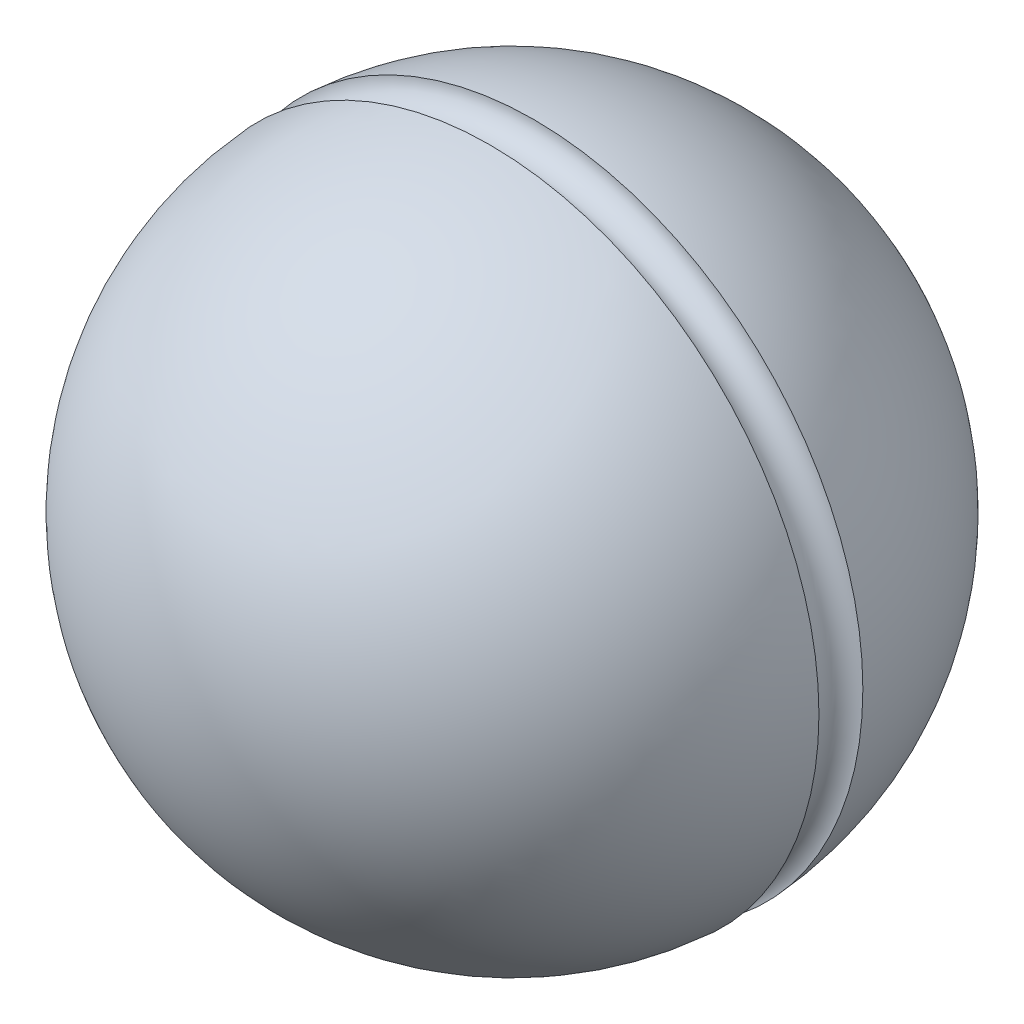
ISO-10303-21;
HEADER;
FILE_DESCRIPTION(('STEP AP214'),'2;1');
FILE_NAME('part.step','',(''),(''),'','','');
FILE_SCHEMA(('AUTOMOTIVE_DESIGN { 1 0 10303 214 1 1 1 1 }'));
ENDSEC;
DATA;
#1=APPLICATION_CONTEXT('core data for automotive mechanical design processes');
#2=APPLICATION_PROTOCOL_DEFINITION('international standard','automotive_design',2000,#1);
#3=PRODUCT_CONTEXT('',#1,'mechanical');
#4=PRODUCT('Part','Part','',(#3));
#5=PRODUCT_RELATED_PRODUCT_CATEGORY('part','',(#4));
#6=PRODUCT_DEFINITION_FORMATION('','',#4);
#7=PRODUCT_DEFINITION_CONTEXT('part definition',#1,'design');
#8=PRODUCT_DEFINITION('design','',#6,#7);
#9=PRODUCT_DEFINITION_SHAPE('','',#8);
#10=(LENGTH_UNIT() NAMED_UNIT(*) SI_UNIT(.MILLI.,.METRE.));
#11=(NAMED_UNIT(*) PLANE_ANGLE_UNIT() SI_UNIT($,.RADIAN.));
#12=(NAMED_UNIT(*) SI_UNIT($,.STERADIAN.) SOLID_ANGLE_UNIT());
#13=UNCERTAINTY_MEASURE_WITH_UNIT(LENGTH_MEASURE(1.E-05),#10,'distance_accuracy_value','');
#14=(GEOMETRIC_REPRESENTATION_CONTEXT(3) GLOBAL_UNCERTAINTY_ASSIGNED_CONTEXT((#13)) GLOBAL_UNIT_ASSIGNED_CONTEXT((#10,
#11,#12)) REPRESENTATION_CONTEXT('',''));
#15=CARTESIAN_POINT('',(0.,0.,0.));
#16=DIRECTION('',(0.,0.,1.));
#17=DIRECTION('',(1.,0.,0.));
#18=AXIS2_PLACEMENT_3D('',#15,#16,#17);
#19=CARTESIAN_POINT('',(5.,0.,18.));
#20=DIRECTION('',(0.,0.,-1.));
#21=DIRECTION('',(0.,1.,0.));
#22=AXIS2_PLACEMENT_3D('',#19,#20,#21);
#23=PLANE('',#22);
#24=CARTESIAN_POINT('',(0.,0.,18.));
#25=DIRECTION('',(0.,0.,-1.));
#26=DIRECTION('',(0.,1.,0.));
#27=AXIS2_PLACEMENT_3D('',#24,#25,#26);
#28=CIRCLE('',#27,5.);
#29=CARTESIAN_POINT('',(0.,5.,18.));
#30=VERTEX_POINT('',#29);
#31=EDGE_CURVE('E8',#30,#30,#28,.T.);
#32=ORIENTED_EDGE('',*,*,#31,.T.);
#33=EDGE_LOOP('',(#32));
#34=FACE_BOUND('',#33,.T.);
#35=ADVANCED_FACE('F12',(#34),#23,.T.);
#36=CARTESIAN_POINT('',(0.,0.,0.));
#37=DIRECTION('',(0.,0.,-1.));
#38=DIRECTION('',(0.,1.,0.));
#39=AXIS2_PLACEMENT_3D('',#36,#37,#38);
#40=CYLINDRICAL_SURFACE('',#39,5.);
#41=CARTESIAN_POINT('',(0.,0.,0.));
#42=DIRECTION('',(0.,0.,-1.));
#43=DIRECTION('',(0.,1.,0.));
#44=AXIS2_PLACEMENT_3D('',#41,#42,#43);
#45=CIRCLE('',#44,5.);
#46=CARTESIAN_POINT('',(0.,5.,0.));
#47=VERTEX_POINT('',#46);
#48=EDGE_CURVE('E18',#47,#47,#45,.T.);
#49=ORIENTED_EDGE('',*,*,#48,.T.);
#50=EDGE_LOOP('',(#49));
#51=FACE_BOUND('',#50,.T.);
#52=ORIENTED_EDGE('',*,*,#31,.F.);
#53=EDGE_LOOP('',(#52));
#54=FACE_BOUND('',#53,.T.);
#55=ADVANCED_FACE('F48',(#51,#54),#40,.F.);
#56=CARTESIAN_POINT('',(7.48331477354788,0.,0.));
#57=DIRECTION('',(0.,0.,-1.));
#58=DIRECTION('',(0.,1.,0.));
#59=AXIS2_PLACEMENT_3D('',#56,#57,#58);
#60=PLANE('',#59);
#61=CARTESIAN_POINT('',(0.,0.,0.));
#62=DIRECTION('',(0.,0.,-1.));
#63=DIRECTION('',(0.,1.,0.));
#64=AXIS2_PLACEMENT_3D('',#61,#62,#63);
#65=CIRCLE('',#64,7.48331477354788);
#66=CARTESIAN_POINT('',(7.48331477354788,0.,0.));
#67=VERTEX_POINT('',#66);
#68=EDGE_CURVE('E22',#67,#67,#65,.T.);
#69=ORIENTED_EDGE('',*,*,#68,.T.);
#70=EDGE_LOOP('',(#69));
#71=FACE_BOUND('',#70,.T.);
#72=ORIENTED_EDGE('',*,*,#48,.F.);
#73=EDGE_LOOP('',(#72));
#74=FACE_BOUND('',#73,.T.);
#75=ADVANCED_FACE('F52',(#71,#74),#60,.T.);
#76=CARTESIAN_POINT('',(0.,0.,13.));
#77=DIRECTION('',(0.,0.,-1.));
#78=DIRECTION('',(1.,0.,0.));
#79=AXIS2_PLACEMENT_3D('',#76,#77,#78);
#80=SPHERICAL_SURFACE('',#79,15.);
#81=CARTESIAN_POINT('',(0.,0.,12.0005557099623));
#82=DIRECTION('',(0.,0.,-1.));
#83=DIRECTION('',(0.,1.,0.));
#84=AXIS2_PLACEMENT_3D('',#81,#82,#83);
#85=CIRCLE('',#84,14.9666666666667);
#86=CARTESIAN_POINT('',(14.9666666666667,0.,12.0005557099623));
#87=VERTEX_POINT('',#86);
#88=EDGE_CURVE('E26',#87,#87,#85,.T.);
#89=CARTESIAN_POINT('',(14.9666666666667,0.,12.0005557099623));
#90=CARTESIAN_POINT('',(14.9564460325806,0.,11.8474898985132));
#91=CARTESIAN_POINT('',(14.9438757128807,0.,11.6945810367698));
#92=CARTESIAN_POINT('',(14.9140510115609,0.,11.3892208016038));
#93=CARTESIAN_POINT('',(14.8967966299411,0.,11.2367694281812));
#94=CARTESIAN_POINT('',(14.8576191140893,0.,10.9324677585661));
#95=CARTESIAN_POINT('',(14.8356959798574,0.,10.7806174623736));
#96=CARTESIAN_POINT('',(14.7872018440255,0.,10.4776608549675));
#97=CARTESIAN_POINT('',(14.7606308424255,0.,10.3265545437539));
#98=CARTESIAN_POINT('',(14.70286591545,0.,10.0252281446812));
#99=CARTESIAN_POINT('',(14.6716719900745,0.,9.87500805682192));
#100=CARTESIAN_POINT('',(14.6046905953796,0.,9.57559550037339));
#101=CARTESIAN_POINT('',(14.56890312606,0.,9.42640303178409));
#102=CARTESIAN_POINT('',(14.4927683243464,0.,9.12918614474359));
#103=CARTESIAN_POINT('',(14.4524209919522,0.,8.98116172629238));
#104=CARTESIAN_POINT('',(14.3672044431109,0.,8.68642027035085));
#105=CARTESIAN_POINT('',(14.3223352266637,0.,8.53970323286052));
#106=CARTESIAN_POINT('',(14.22811714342,0.,8.24771463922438));
#107=CARTESIAN_POINT('',(14.1787682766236,0.,8.10244308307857));
#108=CARTESIAN_POINT('',(14.0756373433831,0.,7.81348219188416));
#109=CARTESIAN_POINT('',(14.021855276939,0.,7.66979285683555));
#110=CARTESIAN_POINT('',(13.9099085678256,0.,7.38413165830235));
#111=CARTESIAN_POINT('',(13.8517439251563,0.,7.24215979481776));
#112=CARTESIAN_POINT('',(13.731086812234,0.,6.96006717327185));
#113=CARTESIAN_POINT('',(13.668594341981,0.,6.81994641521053));
#114=CARTESIAN_POINT('',(13.5393403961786,0.,6.54168789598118));
#115=CARTESIAN_POINT('',(13.4725789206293,0.,6.40355013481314));
#116=CARTESIAN_POINT('',(13.3348498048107,0.,6.12938763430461));
#117=CARTESIAN_POINT('',(13.2638821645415,0.,5.99336289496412));
#118=CARTESIAN_POINT('',(13.1178075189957,0.,5.72355447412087));
#119=CARTESIAN_POINT('',(13.0427005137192,0.,5.58977079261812));
#120=CARTESIAN_POINT('',(12.8884178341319,0.,5.32457041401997));
#121=CARTESIAN_POINT('',(12.8092421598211,0.,5.19315371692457));
#122=CARTESIAN_POINT('',(12.6468966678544,0.,4.93281100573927));
#123=CARTESIAN_POINT('',(12.5637268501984,0.,4.80388499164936));
#124=CARTESIAN_POINT('',(12.393471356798,0.,4.5486450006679));
#125=CARTESIAN_POINT('',(12.3063856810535,0.,4.42233102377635));
#126=CARTESIAN_POINT('',(12.1283804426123,0.,4.17243400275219));
#127=CARTESIAN_POINT('',(12.0374608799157,0.,4.04885095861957));
#128=CARTESIAN_POINT('',(11.8518734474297,0.,3.80453212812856));
#129=CARTESIAN_POINT('',(11.7572055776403,0.,3.68379634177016));
#130=CARTESIAN_POINT('',(11.5642106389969,0.,3.44528567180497));
#131=CARTESIAN_POINT('',(11.4658835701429,0.,3.32751078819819));
#132=CARTESIAN_POINT('',(11.2656627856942,0.,3.09503278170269));
#133=CARTESIAN_POINT('',(11.1637690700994,0.,2.98032965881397));
#134=CARTESIAN_POINT('',(10.9565109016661,0.,2.75410314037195));
#135=CARTESIAN_POINT('',(10.8511464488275,0.,2.64257974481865));
#136=CARTESIAN_POINT('',(10.6370459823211,0.,2.42281765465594));
#137=CARTESIAN_POINT('',(10.5283099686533,0.,2.31457896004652));
#138=CARTESIAN_POINT('',(10.3075687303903,0.,2.10148815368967));
#139=CARTESIAN_POINT('',(10.1955635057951,0.,1.99663604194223));
#140=CARTESIAN_POINT('',(9.96838927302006,0.,1.79041709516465));
#141=CARTESIAN_POINT('',(9.85322026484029,0.,1.6890502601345));
#142=CARTESIAN_POINT('',(9.61982686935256,0.,1.48989728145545));
#143=CARTESIAN_POINT('',(9.50160248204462,0.,1.39211113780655));
#144=CARTESIAN_POINT('',(9.26220961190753,0.,1.2002115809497));
#145=CARTESIAN_POINT('',(9.14104112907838,0.,1.10609816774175));
#146=CARTESIAN_POINT('',(8.8958741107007,0.,0.921632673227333));
#147=CARTESIAN_POINT('',(8.77187557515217,0.,0.831280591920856));
#148=CARTESIAN_POINT('',(8.52116520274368,0.,0.654422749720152));
#149=CARTESIAN_POINT('',(8.39445336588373,0.,0.567916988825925));
#150=CARTESIAN_POINT('',(8.13843552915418,0.,0.398833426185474));
#151=CARTESIAN_POINT('',(8.00912952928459,0.,0.31625562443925));
#152=CARTESIAN_POINT('',(7.74804557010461,0.,0.155104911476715));
#153=CARTESIAN_POINT('',(7.61626761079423,0.,0.0765320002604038));
#154=CARTESIAN_POINT('',(7.48331477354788,0.,0.));
#155=B_SPLINE_CURVE_WITH_KNOTS('',3,(#89,#90,#91,#92,#93,#94,#95,#96,#97,#98,#99,#100,#101,#102,
#103,#104,#105,#106,#107,#108,#109,#110,#111,#112,#113,#114,#115,#116,#117,#118,#119,#120,#121,
#122,#123,#124,#125,#126,#127,#128,#129,#130,#131,#132,#133,#134,#135,#136,#137,#138,#139,#140,
#141,#142,#143,#144,#145,#146,#147,#148,#149,#150,#151,#152,#153,#154),.UNSPECIFIED.,.F.,.F.,(4,
2,2,2,2,2,2,2,2,2,2,2,2,2,2,2,2,2,2,2,2,2,2,2,2,2,2,2,2,2,2,2,4),(0.,0.460201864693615,
0.920403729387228,1.38060559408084,1.84080745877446,2.30100932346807,2.76121118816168,
3.2214130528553,3.68161491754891,4.14181678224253,4.60201864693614,5.06222051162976,
5.52242237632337,5.98262424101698,6.4428261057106,6.90302797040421,7.36322983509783,
7.82343169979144,8.28363356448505,8.74383542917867,9.20403729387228,9.66423915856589,
10.1244410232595,10.5846428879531,11.0448447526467,11.5050466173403,11.965248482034,
12.4254503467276,12.8856522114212,13.3458540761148,13.8060559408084,14.266257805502,
14.7264596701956),.UNSPECIFIED.);
#156=EDGE_CURVE('BSEAM45',#87,#67,#155,.T.);
#157=ORIENTED_EDGE('',*,*,#88,.T.);
#158=ORIENTED_EDGE('',*,*,#68,.F.);
#159=ORIENTED_EDGE('',*,*,#156,.T.);
#160=ORIENTED_EDGE('',*,*,#156,.F.);
#161=EDGE_LOOP('',(#157,#159,#158,#160));
#162=FACE_BOUND('',#161,.T.);
#163=ADVANCED_FACE('F45',(#162),#80,.T.);
#164=CARTESIAN_POINT('',(0.,0.,13.));
#165=DIRECTION('',(0.,0.,-1.));
#166=DIRECTION('',(0.,1.,0.));
#167=AXIS2_PLACEMENT_3D('',#164,#165,#166);
#168=TOROIDAL_SURFACE('',#167,15.,1.);
#169=CARTESIAN_POINT('',(0.,0.,13.9994442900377));
#170=DIRECTION('',(0.,0.,-1.));
#171=DIRECTION('',(0.,1.,0.));
#172=AXIS2_PLACEMENT_3D('',#169,#170,#171);
#173=CIRCLE('',#172,14.9666666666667);
#174=CARTESIAN_POINT('',(0.,14.9666666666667,13.9994442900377));
#175=VERTEX_POINT('',#174);
#176=EDGE_CURVE('E31',#175,#175,#173,.T.);
#177=ORIENTED_EDGE('',*,*,#176,.T.);
#178=EDGE_LOOP('',(#177));
#179=FACE_BOUND('',#178,.T.);
#180=ORIENTED_EDGE('',*,*,#88,.F.);
#181=EDGE_LOOP('',(#180));
#182=FACE_BOUND('',#181,.T.);
#183=ADVANCED_FACE('F35',(#179,#182),#168,.F.);
#184=CARTESIAN_POINT('',(0.,0.,13.));
#185=DIRECTION('',(0.,0.,-1.));
#186=DIRECTION('',(1.,0.,0.));
#187=AXIS2_PLACEMENT_3D('',#184,#185,#186);
#188=SPHERICAL_SURFACE('',#187,15.);
#189=ORIENTED_EDGE('',*,*,#176,.F.);
#190=EDGE_LOOP('',(#189));
#191=FACE_BOUND('',#190,.T.);
#192=ADVANCED_FACE('F38',(#191),#188,.T.);
#193=CLOSED_SHELL('',(#35,#55,#75,#163,#183,#192));
#194=MANIFOLD_SOLID_BREP('B1',#193);
#195=ADVANCED_BREP_SHAPE_REPRESENTATION('',(#18,#194),#14);
#196=SHAPE_DEFINITION_REPRESENTATION(#9,#195);
ENDSEC;
END-ISO-10303-21;
